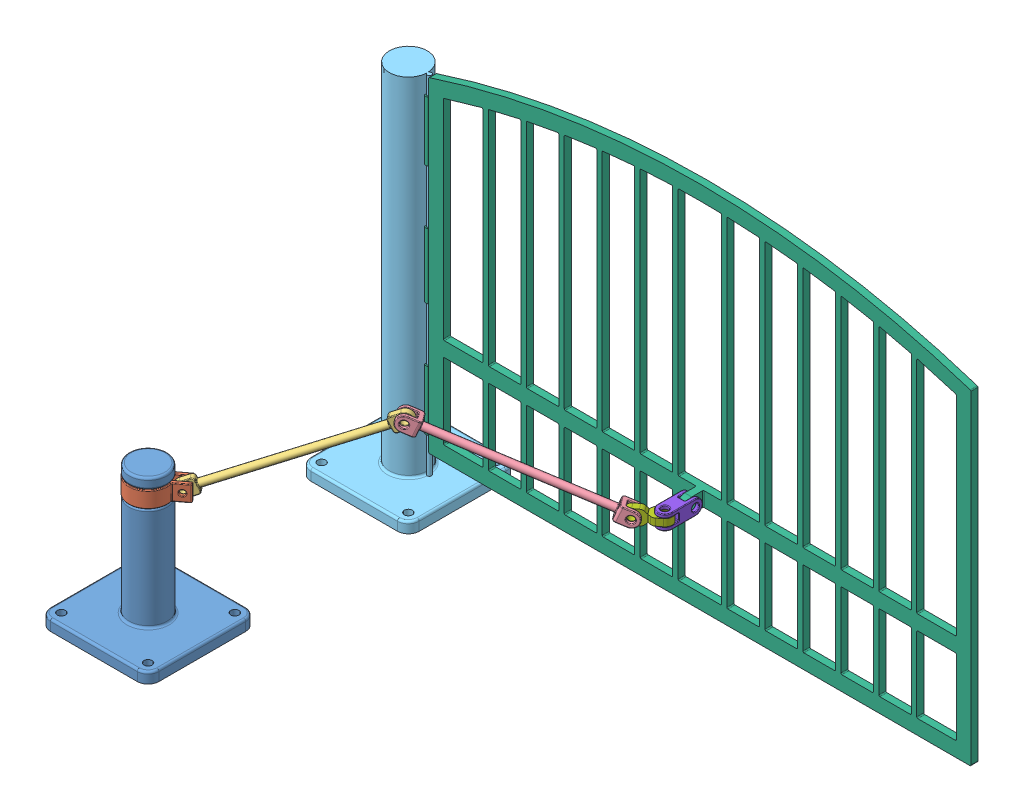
SolidWorks assembly DESN220-51C-MKrueger-Gate Assembly.SLDASM, configuration Default (file format 6000). Lengths in mm.
Overall size (726.39 469.98 431.8).
16 component instances, 8 part files, 21 mates.
Components (placement in the parent):
- Base Stand-1: Base Stand.SLDPRT [Default] at (28.1285 37.43 121.4273) size (127 165.1 127)
- Arm Connector-1: Arm Connector.SLDPRT [Default] at (28.1285 361.407 121.4273) x (0.799211 0 -0.60105) z (0 -1 0) size (60.58 44.96 18.8)
- Arm-1: Arm.SLDPRT [Default] at (51.981 180.178 103.4889) x (0.722166 0.428381 -0.543108) z (0.60105 0 0.799211) size (222.25 17.17 8.51)
- Connecting-Arm-1: Connecting-Arm.SLDPRT [Default] at (200.0825 268.0301 -7.8915) x (0.739397 -0.379582 -0.556067) z (0.60105 0 0.799211) size (222.25 17.17 17.17)
- Gate Support-1: Gate Support.SLDPRT [Default] at (28.1285 37.43 -183.3727) x (-1 0 0) z (0 0 -1) size (127 419.1 127)
- Gate-1: Gate.SLDPRT [Default] at (373.5198 190.1856 -165.6054) x (0 0 -1) z (1 0 0) size (30.48 431.88 642.38)
- Connector Joint-1: Connector Joint.SLDPRT [Default] at (351.7176 190.1856 -121.9294) x (0.799211 0 -0.60105) z (0.60105 0 0.799211) size (44.45 17.17 17.17)
- Double Joint(1)-1: Double Joint(1).SLDPRT [Default] at (373.5198 190.1856 -138.3258) x (0 0 -1) z (0 1 0) size (44.45 17.17 17.17)
- Double Joint(1)-3: Double Joint(1).SLDPRT [Default] at (1011.0597 190.1856 -138.3258) x (0 0 -1) z (0 -1 0) size (44.45 17.17 17.17) (suppressed, hidden)
- Connector Joint-3: Connector Joint.SLDPRT [Default] at (1032.8618 190.1856 -121.9294) x (-0.799211 0 -0.60105) z (0.60105 0 -0.799211) size (44.45 17.17 17.17) (suppressed, hidden)
- Arm Connector-3: Arm Connector.SLDPRT [Default] at (1356.451 -0.7935 121.4273) x (-0.799211 0 -0.60105) z (0 1 0) size (60.58 44.96 18.8) (suppressed, hidden)
- Arm-3: Arm.SLDPRT [Default] at (1332.5985 180.178 103.4889) x (-0.722166 0.428381 -0.543108) z (0.60105 0 -0.799211) size (222.25 17.17 8.51) (suppressed, hidden)
- Gate-3: Gate.SLDPRT [Default] at (1011.0597 190.1856 -201.0295) x (0 0 1) z (-1 0 0) size (30.48 431.88 642.38) (suppressed, hidden)
- Gate Support-3: Gate Support.SLDPRT [Default] at (1356.451 37.43 -183.3727) size (127 419.1 127) (suppressed, hidden)
- Connecting-Arm-3: Connecting-Arm.SLDPRT [Default] at (1184.497 268.0301 -7.8915) x (-0.739397 -0.379582 -0.556067) z (0.60105 0 -0.799211) size (222.25 17.17 17.17) (suppressed, hidden)
- Base Stand-3: Base Stand.SLDPRT [Default] at (1356.451 37.43 121.4273) x (-1 0 0) z (0 0 -1) size (127 165.1 127) (suppressed, hidden)
Mates (geometry in assembly coordinates):
- Coincident2: coincident aligned: plane of Base Stand-1 through (78.9285 37.43 172.2273) normal (0 -1 0); plane of Gate Support-1 through (-22.6715 37.43 -234.1727) normal (0 -1 0)
- Concentric1: concentric anti-aligned: cylinder of Base Stand-1 through (28.1285 37.43 121.4273) axis (0 -1 0) radius 12.7; cylinder of Arm Connector-1 through (28.1285 170.907 121.4273) axis (0 1 0) radius 12.954
- Width1: width aligned: plane of Arm Connector-1 through (53.124 189.703 93.81) normal (0 1 0); plane of Arm Connector-1 through (53.124 170.907 93.81) normal (0 -1 0); plane of Base Stand-1 through (40.8285 170.78 121.4273) normal (0 1 0); plane of Base Stand-1 through (50.3535 189.83 121.4273) normal (0 -1 0)
- Width2: width anti-aligned: plane of Arm-1 through (54.4618 180.178 106.7877) normal (0.60105 0 0.799211); plane of Arm-1 through (49.5001 180.178 100.1902) normal (-0.60105 0 -0.799211); plane of Arm Connector-1 through (41.2624 170.907 116.7144) normal (-0.60105 0 -0.799211); plane of Arm Connector-1 through (36.3007 170.907 110.1169) normal (0.60105 0 0.799211)
- Concentric2: concentric anti-aligned: cylinder of Arm Connector-1 through (65.492 180.178 121.4544) axis (-0.60105 0 -0.799211) radius 3.175; cylinder of Arm-1 through (49.5001 180.178 100.1902) axis (0.60105 0 0.799211) radius 4.1275
- Concentric3: concentric anti-aligned: cylinder of Arm-1 through (197.6016 268.0301 -11.1902) axis (0.60105 0 0.799211) radius 4.1275; cylinder of Connecting-Arm-1 through (205.2426 268.0301 -1.0301) axis (-0.60105 0 -0.799211) radius 4.1275
- Width3: width anti-aligned: plane of Arm-1 through (202.5633 268.0301 -4.5927) normal (0.60105 0 0.799211); plane of Arm-1 through (197.6016 268.0301 -11.1902) normal (-0.60105 0 -0.799211); plane of Connecting-Arm-1 through (193.611 263.3462 2.1399) normal (-0.60105 0 -0.799211); plane of Connecting-Arm-1 through (188.6493 263.3462 -4.4576) normal (0.60105 0 0.799211)
- Coincident4: coincident aligned: plane of Base Stand-1 through (91.6285 50.13 172.2273) normal (1 0 0); plane of Gate Support-1 through (91.6285 50.13 -234.1727) normal (1 0 0)
- Distance1: distance = 177.8 mm anti-aligned: plane of Gate Support-1 through (78.9285 50.13 -119.8727) normal (0 0 1); plane of Base Stand-1 through (-22.6715 50.13 57.9273) normal (0 0 -1)
- Concentric4: concentric anti-aligned: cylinder of Gate Support-1 through (52.7665 42.9458 -183.3727) axis (0 1 0) radius 2.54; cylinder of Gate-1 through (52.7665 435.6004 -183.3727) axis (0 -1 0) radius 2.54
- Concentric5: concentric anti-aligned: cylinder of Gate Support-1 through (52.7665 42.9458 -183.3727) axis (0 1 0) radius 2.54; cylinder of Gate-1 through (52.7665 435.6004 -183.3727) axis (0 -1 0) radius 2.54
- Concentric6: concentric anti-aligned: cylinder of Gate Support-1 through (52.7665 42.9458 -183.3727) axis (0 1 0) radius 2.54; cylinder of Gate-1 through (52.7665 435.6004 -183.3727) axis (0 -1 0) radius 2.54
- Width4: width aligned: plane of Connector Joint-1 through (354.1985 190.1856 -118.6307) normal (0.60105 0 0.799211); plane of Connector Joint-1 through (349.2368 190.1856 -125.2281) normal (-0.60105 0 -0.799211); plane of Connecting-Arm-1 through (352.9802 178.9841 -128.0434) normal (0.60105 0 0.799211); plane of Connecting-Arm-1 through (357.9419 178.9841 -121.4459) normal (-0.60105 0 -0.799211)
- Concentric7: concentric aligned: cylinder of Connecting-Arm-1 through (356.8778 190.1856 -115.068) axis (-0.60105 0 -0.799211) radius 4.1275; cylinder of Connector Joint-1 through (354.1985 190.1856 -118.6307) axis (-0.60105 0 -0.799211) radius 4.1275
- Concentric8: concentric anti-aligned: cylinder of Connector Joint-1 through (373.5198 186.0581 -138.3258) axis (0 1 0) radius 4.1275; cylinder of Double Joint(1)-1 through (373.5198 198.7708 -138.3258) axis (0 -1 0) radius 4.1275
- Width5: width anti-aligned: plane of Connector Joint-1 through (373.5198 194.3131 -138.3258) normal (0 1 0); plane of Connector Joint-1 through (373.5198 186.0581 -138.3258) normal (0 -1 0); plane of Double Joint(1)-1 through (382.105 194.3131 -129.7406) normal (0 -1 0); plane of Double Joint(1)-1 through (382.105 186.0581 -129.7406) normal (0 1 0)
- Width7: width anti-aligned: plane of Gate-1 through (377.6473 190.1856 -165.6054) normal (1 0 0); plane of Gate-1 through (369.3923 190.1856 -165.6054) normal (-1 0 0); plane of Double Joint(1)-1 through (377.6473 198.7708 -157.6806) normal (-1 0 0); plane of Double Joint(1)-1 through (369.3923 198.7708 -157.6806) normal (1 0 0)
- Concentric10: concentric anti-aligned: cylinder of Gate-1 through (377.6473 190.1856 -165.6054) axis (-1 0 0) radius 4.1275; cylinder of Double Joint(1)-1 through (364.9346 190.1856 -165.6054) axis (1 0 0) radius 4.1275
- Distance2: distance = 25.4 mm anti-aligned: plane of Gate Support-1 through (-22.6715 50.13 -234.1727) normal (0 1 0); plane of Gate-1 through (691.0198 75.53 -187.5002) normal (0 -1 0)
- Angle1: planar angle = 1.570796 rad aligned: plane of Gate-1 through (373.5198 -508.5865 -179.2452) normal (0 0 1); plane of Gate Support-1 through (-35.3715 50.13 -234.1727) normal (-1 0 0)
- Angle2: planar angle = 0.386815 rad aligned: plane of Gate Support-1 through (-35.3715 50.13 -234.1727) normal (-1 0 0); plane of Gate-1 through (169.9452 -508.5865 115.2388) normal (-0.926115 0 0.377241)
